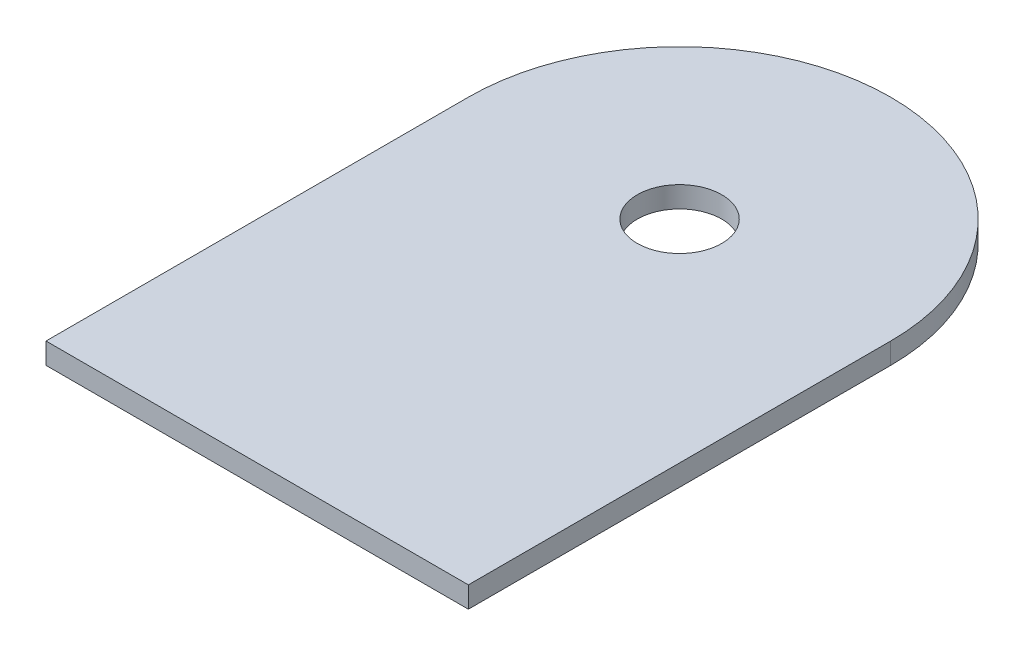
from build123d import *

# Parameters (mm, degrees)
SKETCH2_R           = 4
BOSS_EXTRUDE1_DEPTH = 2


with BuildPart() as part:
    # Sketch2 → Boss-Extrude1 (new body)
    with BuildSketch(Plane(origin=(0, 0, 0), x_dir=(1, 0, 0), z_dir=(0, 1, 0))):
        with BuildLine():
            Line((20, 0), (20, -40))
            Line((20, -40), (-20, -40))
            Line((-20, -40), (-20, 0))
            ThreePointArc((-20, 0), (0, 20), (20, 0))
        make_face()
        with Locations(Location((0, 0, 0), (0, 0, 270))):
            Circle(SKETCH2_R, mode=Mode.SUBTRACT)
    extrude(amount=BOSS_EXTRUDE1_DEPTH)


solid = part.part
